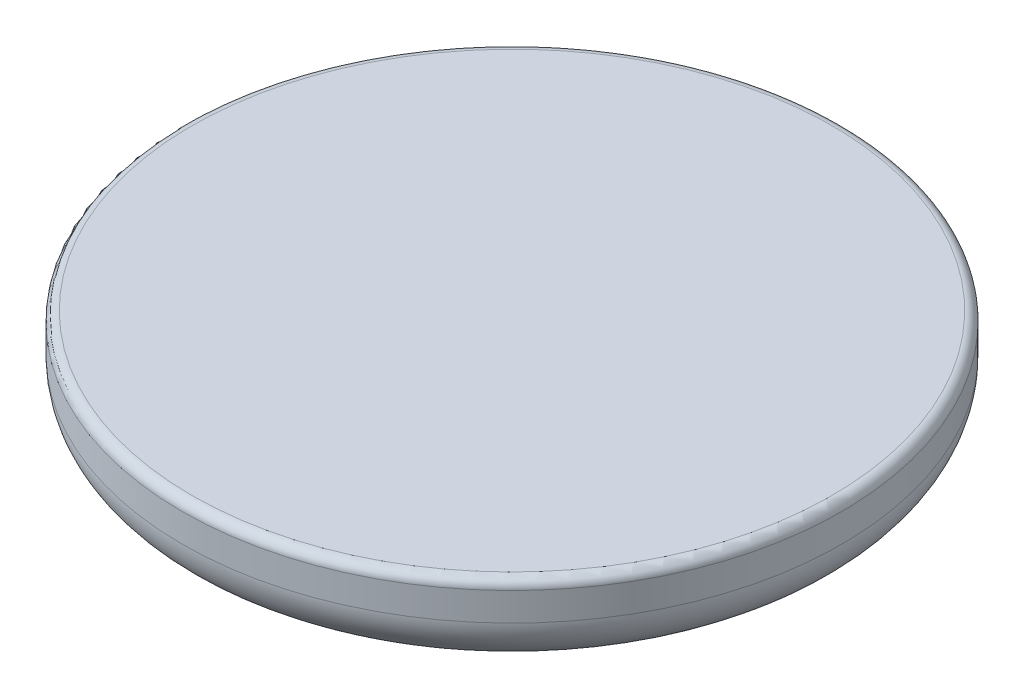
ISO-10303-21;
HEADER;
FILE_DESCRIPTION(('STEP AP214'),'2;1');
FILE_NAME('part.step','',(''),(''),'','','');
FILE_SCHEMA(('AUTOMOTIVE_DESIGN { 1 0 10303 214 1 1 1 1 }'));
ENDSEC;
DATA;
#1=APPLICATION_CONTEXT('core data for automotive mechanical design processes');
#2=APPLICATION_PROTOCOL_DEFINITION('international standard','automotive_design',2000,#1);
#3=PRODUCT_CONTEXT('',#1,'mechanical');
#4=PRODUCT('Part','Part','',(#3));
#5=PRODUCT_RELATED_PRODUCT_CATEGORY('part','',(#4));
#6=PRODUCT_DEFINITION_FORMATION('','',#4);
#7=PRODUCT_DEFINITION_CONTEXT('part definition',#1,'design');
#8=PRODUCT_DEFINITION('design','',#6,#7);
#9=PRODUCT_DEFINITION_SHAPE('','',#8);
#10=(LENGTH_UNIT() NAMED_UNIT(*) SI_UNIT(.MILLI.,.METRE.));
#11=(NAMED_UNIT(*) PLANE_ANGLE_UNIT() SI_UNIT($,.RADIAN.));
#12=(NAMED_UNIT(*) SI_UNIT($,.STERADIAN.) SOLID_ANGLE_UNIT());
#13=UNCERTAINTY_MEASURE_WITH_UNIT(LENGTH_MEASURE(1.E-05),#10,'distance_accuracy_value','');
#14=(GEOMETRIC_REPRESENTATION_CONTEXT(3) GLOBAL_UNCERTAINTY_ASSIGNED_CONTEXT((#13)) GLOBAL_UNIT_ASSIGNED_CONTEXT((#10,
#11,#12)) REPRESENTATION_CONTEXT('',''));
#15=CARTESIAN_POINT('',(0.,0.,0.));
#16=DIRECTION('',(0.,0.,1.));
#17=DIRECTION('',(1.,0.,0.));
#18=AXIS2_PLACEMENT_3D('',#15,#16,#17);
#19=CARTESIAN_POINT('',(0.,9.,0.));
#20=DIRECTION('',(0.,-1.,0.));
#21=DIRECTION('',(0.,0.,-1.));
#22=AXIS2_PLACEMENT_3D('',#19,#20,#21);
#23=CYLINDRICAL_SURFACE('',#22,35.);
#24=CARTESIAN_POINT('',(0.,8.,0.));
#25=DIRECTION('',(0.,1.,0.));
#26=DIRECTION('',(0.,0.,1.));
#27=AXIS2_PLACEMENT_3D('',#24,#25,#26);
#28=CIRCLE('',#27,35.);
#29=CARTESIAN_POINT('',(0.,8.,35.));
#30=VERTEX_POINT('',#29);
#31=EDGE_CURVE('E10',#30,#30,#28,.F.);
#32=ORIENTED_EDGE('',*,*,#31,.T.);
#33=EDGE_LOOP('',(#32));
#34=FACE_BOUND('',#33,.T.);
#35=CARTESIAN_POINT('',(0.,5.,0.));
#36=DIRECTION('',(0.,1.,0.));
#37=DIRECTION('',(0.,0.,1.));
#38=AXIS2_PLACEMENT_3D('',#35,#36,#37);
#39=CIRCLE('',#38,35.);
#40=CARTESIAN_POINT('',(0.,5.,35.));
#41=VERTEX_POINT('',#40);
#42=EDGE_CURVE('E57',#41,#41,#39,.T.);
#43=ORIENTED_EDGE('',*,*,#42,.T.);
#44=EDGE_LOOP('',(#43));
#45=FACE_BOUND('',#44,.T.);
#46=ADVANCED_FACE('F39',(#34,#45),#23,.T.);
#47=CARTESIAN_POINT('',(0.,9.,0.));
#48=DIRECTION('',(0.,1.,0.));
#49=DIRECTION('',(0.,0.,1.));
#50=AXIS2_PLACEMENT_3D('',#47,#48,#49);
#51=PLANE('',#50);
#52=CARTESIAN_POINT('',(0.,9.,0.));
#53=DIRECTION('',(0.,1.,0.));
#54=DIRECTION('',(0.,0.,1.));
#55=AXIS2_PLACEMENT_3D('',#52,#53,#54);
#56=CIRCLE('',#55,34.);
#57=CARTESIAN_POINT('',(0.,9.,34.));
#58=VERTEX_POINT('',#57);
#59=EDGE_CURVE('E47',#58,#58,#56,.T.);
#60=ORIENTED_EDGE('',*,*,#59,.T.);
#61=EDGE_LOOP('',(#60));
#62=FACE_BOUND('',#61,.T.);
#63=ADVANCED_FACE('F74',(#62),#51,.T.);
#64=CARTESIAN_POINT('',(0.,0.,0.));
#65=DIRECTION('',(0.,1.,0.));
#66=DIRECTION('',(0.,0.,1.));
#67=AXIS2_PLACEMENT_3D('',#64,#65,#66);
#68=PLANE('',#67);
#69=CARTESIAN_POINT('',(0.,0.,0.));
#70=DIRECTION('',(0.,1.,0.));
#71=DIRECTION('',(0.,0.,1.));
#72=AXIS2_PLACEMENT_3D('',#69,#70,#71);
#73=CIRCLE('',#72,30.);
#74=CARTESIAN_POINT('',(0.,0.,30.));
#75=VERTEX_POINT('',#74);
#76=EDGE_CURVE('E52',#75,#75,#73,.F.);
#77=ORIENTED_EDGE('',*,*,#76,.T.);
#78=EDGE_LOOP('',(#77));
#79=FACE_BOUND('',#78,.T.);
#80=ADVANCED_FACE('F67',(#79),#68,.F.);
#81=CARTESIAN_POINT('',(0.,5.,0.));
#82=DIRECTION('',(0.,1.,0.));
#83=DIRECTION('',(0.,0.,1.));
#84=AXIS2_PLACEMENT_3D('',#81,#82,#83);
#85=TOROIDAL_SURFACE('',#84,30.,5.);
#86=ORIENTED_EDGE('',*,*,#76,.F.);
#87=EDGE_LOOP('',(#86));
#88=FACE_BOUND('',#87,.T.);
#89=ORIENTED_EDGE('',*,*,#42,.F.);
#90=EDGE_LOOP('',(#89));
#91=FACE_BOUND('',#90,.T.);
#92=ADVANCED_FACE('F65',(#88,#91),#85,.T.);
#93=CARTESIAN_POINT('',(0.,8.,0.));
#94=DIRECTION('',(0.,1.,0.));
#95=DIRECTION('',(0.,0.,1.));
#96=AXIS2_PLACEMENT_3D('',#93,#94,#95);
#97=TOROIDAL_SURFACE('',#96,34.,1.);
#98=ORIENTED_EDGE('',*,*,#31,.F.);
#99=EDGE_LOOP('',(#98));
#100=FACE_BOUND('',#99,.T.);
#101=ORIENTED_EDGE('',*,*,#59,.F.);
#102=EDGE_LOOP('',(#101));
#103=FACE_BOUND('',#102,.T.);
#104=ADVANCED_FACE('F41',(#100,#103),#97,.T.);
#105=CLOSED_SHELL('',(#46,#63,#80,#92,#104));
#106=MANIFOLD_SOLID_BREP('B2',#105);
#107=ADVANCED_BREP_SHAPE_REPRESENTATION('',(#18,#106),#14);
#108=SHAPE_DEFINITION_REPRESENTATION(#9,#107);
ENDSEC;
END-ISO-10303-21;
